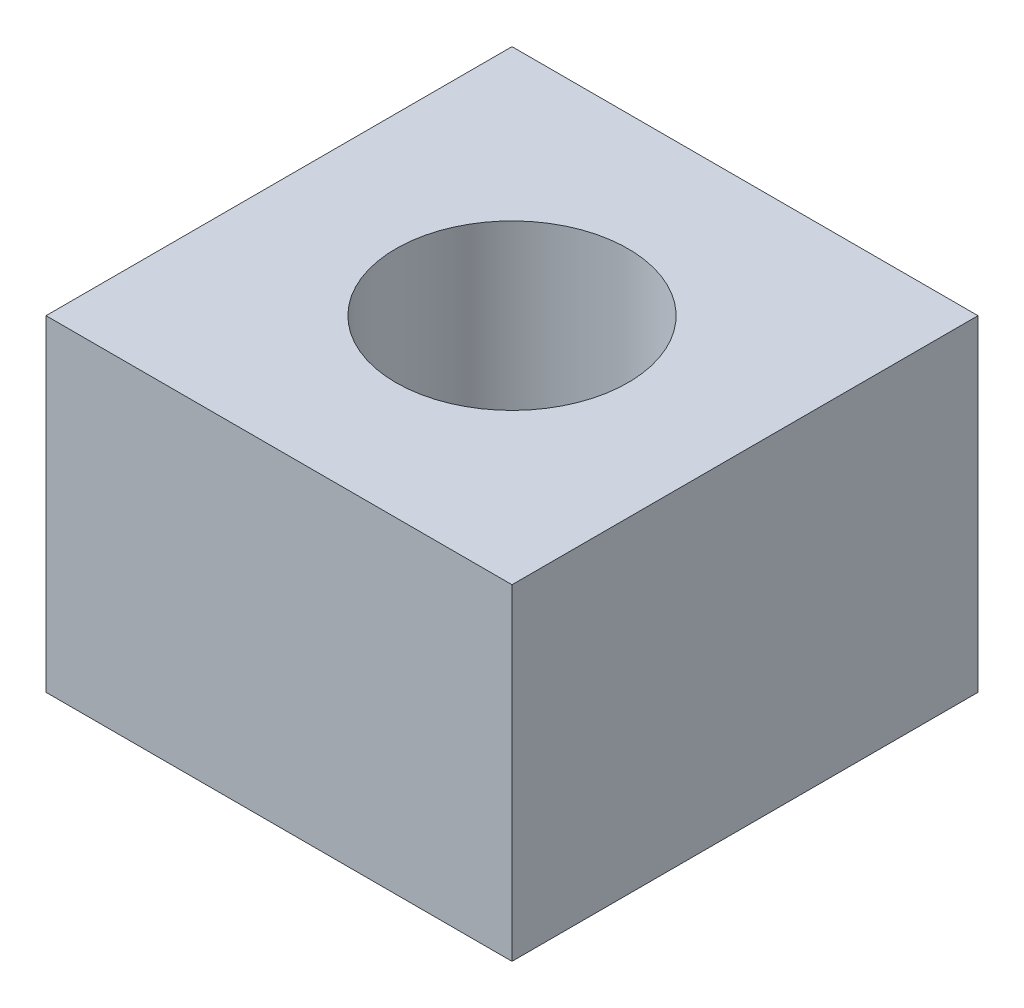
ISO-10303-21;
HEADER;
FILE_DESCRIPTION(('STEP AP214'),'2;1');
FILE_NAME('part.step','',(''),(''),'','','');
FILE_SCHEMA(('AUTOMOTIVE_DESIGN { 1 0 10303 214 1 1 1 1 }'));
ENDSEC;
DATA;
#1=APPLICATION_CONTEXT('core data for automotive mechanical design processes');
#2=APPLICATION_PROTOCOL_DEFINITION('international standard','automotive_design',2000,#1);
#3=PRODUCT_CONTEXT('',#1,'mechanical');
#4=PRODUCT('Part','Part','',(#3));
#5=PRODUCT_RELATED_PRODUCT_CATEGORY('part','',(#4));
#6=PRODUCT_DEFINITION_FORMATION('','',#4);
#7=PRODUCT_DEFINITION_CONTEXT('part definition',#1,'design');
#8=PRODUCT_DEFINITION('design','',#6,#7);
#9=PRODUCT_DEFINITION_SHAPE('','',#8);
#10=(LENGTH_UNIT() NAMED_UNIT(*) SI_UNIT(.MILLI.,.METRE.));
#11=(NAMED_UNIT(*) PLANE_ANGLE_UNIT() SI_UNIT($,.RADIAN.));
#12=(NAMED_UNIT(*) SI_UNIT($,.STERADIAN.) SOLID_ANGLE_UNIT());
#13=UNCERTAINTY_MEASURE_WITH_UNIT(LENGTH_MEASURE(1.E-05),#10,'distance_accuracy_value','');
#14=(GEOMETRIC_REPRESENTATION_CONTEXT(3) GLOBAL_UNCERTAINTY_ASSIGNED_CONTEXT((#13)) GLOBAL_UNIT_ASSIGNED_CONTEXT((#10,
#11,#12)) REPRESENTATION_CONTEXT('',''));
#15=CARTESIAN_POINT('',(0.,0.,0.));
#16=DIRECTION('',(0.,0.,1.));
#17=DIRECTION('',(1.,0.,0.));
#18=AXIS2_PLACEMENT_3D('',#15,#16,#17);
#19=CARTESIAN_POINT('',(0.,140.,0.));
#20=DIRECTION('',(0.,1.,0.));
#21=DIRECTION('',(0.,0.,1.));
#22=AXIS2_PLACEMENT_3D('',#19,#20,#21);
#23=PLANE('',#22);
#24=DIRECTION('',(0.,0.,1.));
#25=VECTOR('',#24,1.);
#26=CARTESIAN_POINT('',(-104.347826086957,140.,-83.1521739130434));
#27=LINE('',#26,#25);
#28=CARTESIAN_POINT('',(-104.347826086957,140.,-83.1521739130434));
#29=VERTEX_POINT('',#28);
#30=CARTESIAN_POINT('',(-104.347826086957,140.,116.847826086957));
#31=VERTEX_POINT('',#30);
#32=EDGE_CURVE('E87',#29,#31,#27,.T.);
#33=ORIENTED_EDGE('',*,*,#32,.T.);
#34=DIRECTION('',(1.,0.,0.));
#35=VECTOR('',#34,1.);
#36=CARTESIAN_POINT('',(-104.347826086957,140.,116.847826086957));
#37=LINE('',#36,#35);
#38=CARTESIAN_POINT('',(95.6521739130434,140.,116.847826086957));
#39=VERTEX_POINT('',#38);
#40=EDGE_CURVE('E82',#31,#39,#37,.T.);
#41=ORIENTED_EDGE('',*,*,#40,.T.);
#42=DIRECTION('',(0.,0.,-1.));
#43=VECTOR('',#42,1.);
#44=CARTESIAN_POINT('',(95.6521739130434,140.,-83.1521739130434));
#45=LINE('',#44,#43);
#46=CARTESIAN_POINT('',(95.6521739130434,140.,-83.1521739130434));
#47=VERTEX_POINT('',#46);
#48=EDGE_CURVE('E85',#39,#47,#45,.T.);
#49=ORIENTED_EDGE('',*,*,#48,.T.);
#50=DIRECTION('',(-1.,0.,0.));
#51=VECTOR('',#50,1.);
#52=CARTESIAN_POINT('',(-104.347826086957,140.,-83.1521739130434));
#53=LINE('',#52,#51);
#54=EDGE_CURVE('E52',#47,#29,#53,.T.);
#55=ORIENTED_EDGE('',*,*,#54,.T.);
#56=EDGE_LOOP('',(#33,#41,#49,#55));
#57=FACE_BOUND('',#56,.T.);
#58=CARTESIAN_POINT('',(-4.34782608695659,140.,16.8478260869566));
#59=DIRECTION('',(0.,1.,0.));
#60=DIRECTION('',(0.,0.,1.));
#61=AXIS2_PLACEMENT_3D('',#58,#59,#60);
#62=CIRCLE('',#61,49.8166858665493);
#63=CARTESIAN_POINT('',(-4.34782608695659,140.,66.6645119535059));
#64=VERTEX_POINT('',#63);
#65=EDGE_CURVE('E102',#64,#64,#62,.T.);
#66=ORIENTED_EDGE('',*,*,#65,.F.);
#67=EDGE_LOOP('',(#66));
#68=FACE_BOUND('',#67,.T.);
#69=ADVANCED_FACE('F35',(#57,#68),#23,.T.);
#70=CARTESIAN_POINT('',(0.,0.,0.));
#71=DIRECTION('',(0.,1.,0.));
#72=DIRECTION('',(0.,0.,1.));
#73=AXIS2_PLACEMENT_3D('',#70,#71,#72);
#74=PLANE('',#73);
#75=DIRECTION('',(0.,0.,1.));
#76=VECTOR('',#75,1.);
#77=CARTESIAN_POINT('',(-104.347826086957,0.,-83.1521739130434));
#78=LINE('',#77,#76);
#79=CARTESIAN_POINT('',(-104.347826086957,0.,-83.1521739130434));
#80=VERTEX_POINT('',#79);
#81=CARTESIAN_POINT('',(-104.347826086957,0.,116.847826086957));
#82=VERTEX_POINT('',#81);
#83=EDGE_CURVE('E99',#80,#82,#78,.T.);
#84=ORIENTED_EDGE('',*,*,#83,.F.);
#85=DIRECTION('',(-1.,0.,0.));
#86=VECTOR('',#85,1.);
#87=CARTESIAN_POINT('',(-104.347826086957,0.,-83.1521739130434));
#88=LINE('',#87,#86);
#89=CARTESIAN_POINT('',(95.6521739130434,0.,-83.1521739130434));
#90=VERTEX_POINT('',#89);
#91=EDGE_CURVE('E75',#90,#80,#88,.T.);
#92=ORIENTED_EDGE('',*,*,#91,.F.);
#93=DIRECTION('',(0.,0.,-1.));
#94=VECTOR('',#93,1.);
#95=CARTESIAN_POINT('',(95.6521739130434,0.,-83.1521739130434));
#96=LINE('',#95,#94);
#97=CARTESIAN_POINT('',(95.6521739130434,0.,116.847826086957));
#98=VERTEX_POINT('',#97);
#99=EDGE_CURVE('E69',#98,#90,#96,.T.);
#100=ORIENTED_EDGE('',*,*,#99,.F.);
#101=DIRECTION('',(1.,0.,0.));
#102=VECTOR('',#101,1.);
#103=CARTESIAN_POINT('',(-104.347826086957,0.,116.847826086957));
#104=LINE('',#103,#102);
#105=EDGE_CURVE('E91',#82,#98,#104,.T.);
#106=ORIENTED_EDGE('',*,*,#105,.F.);
#107=EDGE_LOOP('',(#84,#92,#100,#106));
#108=FACE_BOUND('',#107,.T.);
#109=CARTESIAN_POINT('',(-4.34782608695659,0.,16.8478260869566));
#110=DIRECTION('',(0.,1.,0.));
#111=DIRECTION('',(0.,0.,1.));
#112=AXIS2_PLACEMENT_3D('',#109,#110,#111);
#113=CIRCLE('',#112,49.8166858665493);
#114=CARTESIAN_POINT('',(-4.34782608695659,0.,66.6645119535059));
#115=VERTEX_POINT('',#114);
#116=EDGE_CURVE('E114',#115,#115,#113,.T.);
#117=ORIENTED_EDGE('',*,*,#116,.T.);
#118=EDGE_LOOP('',(#117));
#119=FACE_BOUND('',#118,.T.);
#120=ADVANCED_FACE('F110',(#108,#119),#74,.F.);
#121=CARTESIAN_POINT('',(-104.347826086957,140.,-83.1521739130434));
#122=DIRECTION('',(1.,0.,0.));
#123=DIRECTION('',(0.,0.,-1.));
#124=AXIS2_PLACEMENT_3D('',#121,#122,#123);
#125=PLANE('',#124);
#126=ORIENTED_EDGE('',*,*,#83,.T.);
#127=DIRECTION('',(0.,-1.,0.));
#128=VECTOR('',#127,1.);
#129=CARTESIAN_POINT('',(-104.347826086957,140.,116.847826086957));
#130=LINE('',#129,#128);
#131=EDGE_CURVE('E11',#31,#82,#130,.T.);
#132=ORIENTED_EDGE('',*,*,#131,.F.);
#133=ORIENTED_EDGE('',*,*,#32,.F.);
#134=DIRECTION('',(0.,-1.,0.));
#135=VECTOR('',#134,1.);
#136=CARTESIAN_POINT('',(-104.347826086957,140.,-83.1521739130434));
#137=LINE('',#136,#135);
#138=EDGE_CURVE('E95',#29,#80,#137,.T.);
#139=ORIENTED_EDGE('',*,*,#138,.T.);
#140=EDGE_LOOP('',(#126,#132,#133,#139));
#141=FACE_BOUND('',#140,.T.);
#142=ADVANCED_FACE('F37',(#141),#125,.F.);
#143=CARTESIAN_POINT('',(-104.347826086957,140.,116.847826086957));
#144=DIRECTION('',(0.,0.,-1.));
#145=DIRECTION('',(-1.,0.,0.));
#146=AXIS2_PLACEMENT_3D('',#143,#144,#145);
#147=PLANE('',#146);
#148=ORIENTED_EDGE('',*,*,#105,.T.);
#149=DIRECTION('',(0.,-1.,0.));
#150=VECTOR('',#149,1.);
#151=CARTESIAN_POINT('',(95.6521739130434,140.,116.847826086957));
#152=LINE('',#151,#150);
#153=EDGE_CURVE('E44',#39,#98,#152,.T.);
#154=ORIENTED_EDGE('',*,*,#153,.F.);
#155=ORIENTED_EDGE('',*,*,#40,.F.);
#156=ORIENTED_EDGE('',*,*,#131,.T.);
#157=EDGE_LOOP('',(#148,#154,#155,#156));
#158=FACE_BOUND('',#157,.T.);
#159=ADVANCED_FACE('F90',(#158),#147,.F.);
#160=CARTESIAN_POINT('',(95.6521739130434,140.,-83.1521739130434));
#161=DIRECTION('',(-1.,0.,0.));
#162=DIRECTION('',(0.,0.,1.));
#163=AXIS2_PLACEMENT_3D('',#160,#161,#162);
#164=PLANE('',#163);
#165=ORIENTED_EDGE('',*,*,#99,.T.);
#166=DIRECTION('',(0.,-1.,0.));
#167=VECTOR('',#166,1.);
#168=CARTESIAN_POINT('',(95.6521739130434,140.,-83.1521739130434));
#169=LINE('',#168,#167);
#170=EDGE_CURVE('E92',#47,#90,#169,.T.);
#171=ORIENTED_EDGE('',*,*,#170,.F.);
#172=ORIENTED_EDGE('',*,*,#48,.F.);
#173=ORIENTED_EDGE('',*,*,#153,.T.);
#174=EDGE_LOOP('',(#165,#171,#172,#173));
#175=FACE_BOUND('',#174,.T.);
#176=ADVANCED_FACE('F93',(#175),#164,.F.);
#177=CARTESIAN_POINT('',(-104.347826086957,140.,-83.1521739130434));
#178=DIRECTION('',(0.,0.,1.));
#179=DIRECTION('',(1.,0.,0.));
#180=AXIS2_PLACEMENT_3D('',#177,#178,#179);
#181=PLANE('',#180);
#182=ORIENTED_EDGE('',*,*,#91,.T.);
#183=ORIENTED_EDGE('',*,*,#138,.F.);
#184=ORIENTED_EDGE('',*,*,#54,.F.);
#185=ORIENTED_EDGE('',*,*,#170,.T.);
#186=EDGE_LOOP('',(#182,#183,#184,#185));
#187=FACE_BOUND('',#186,.T.);
#188=ADVANCED_FACE('F107',(#187),#181,.F.);
#189=CARTESIAN_POINT('',(-4.34782608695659,140.,16.8478260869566));
#190=DIRECTION('',(0.,-1.,0.));
#191=DIRECTION('',(0.,0.,-1.));
#192=AXIS2_PLACEMENT_3D('',#189,#190,#191);
#193=CYLINDRICAL_SURFACE('',#192,49.8166858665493);
#194=ORIENTED_EDGE('',*,*,#65,.T.);
#195=EDGE_LOOP('',(#194));
#196=FACE_BOUND('',#195,.T.);
#197=ORIENTED_EDGE('',*,*,#116,.F.);
#198=EDGE_LOOP('',(#197));
#199=FACE_BOUND('',#198,.T.);
#200=ADVANCED_FACE('F120',(#196,#199),#193,.F.);
#201=CLOSED_SHELL('',(#69,#120,#142,#159,#176,#188,#200));
#202=MANIFOLD_SOLID_BREP('B2',#201);
#203=ADVANCED_BREP_SHAPE_REPRESENTATION('',(#18,#202),#14);
#204=SHAPE_DEFINITION_REPRESENTATION(#9,#203);
ENDSEC;
END-ISO-10303-21;
